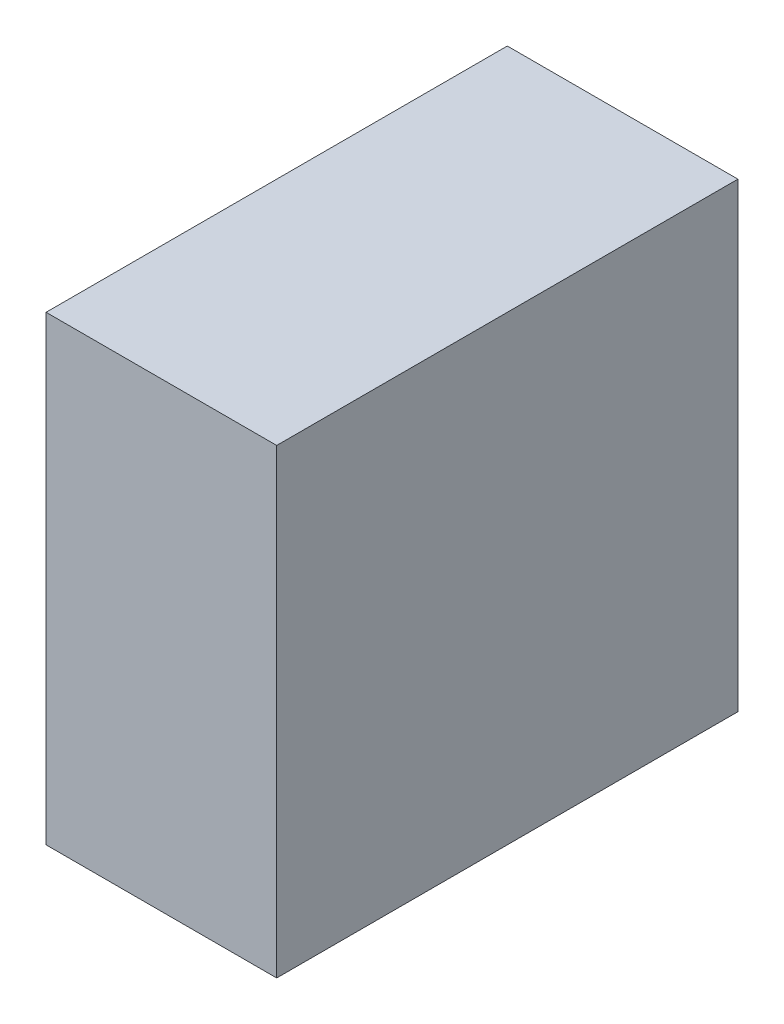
ISO-10303-21;
HEADER;
FILE_DESCRIPTION(('STEP AP214'),'2;1');
FILE_NAME('part.step','',(''),(''),'','','');
FILE_SCHEMA(('AUTOMOTIVE_DESIGN { 1 0 10303 214 1 1 1 1 }'));
ENDSEC;
DATA;
#1=APPLICATION_CONTEXT('core data for automotive mechanical design processes');
#2=APPLICATION_PROTOCOL_DEFINITION('international standard','automotive_design',2000,#1);
#3=PRODUCT_CONTEXT('',#1,'mechanical');
#4=PRODUCT('Part','Part','',(#3));
#5=PRODUCT_RELATED_PRODUCT_CATEGORY('part','',(#4));
#6=PRODUCT_DEFINITION_FORMATION('','',#4);
#7=PRODUCT_DEFINITION_CONTEXT('part definition',#1,'design');
#8=PRODUCT_DEFINITION('design','',#6,#7);
#9=PRODUCT_DEFINITION_SHAPE('','',#8);
#10=(LENGTH_UNIT() NAMED_UNIT(*) SI_UNIT(.MILLI.,.METRE.));
#11=(NAMED_UNIT(*) PLANE_ANGLE_UNIT() SI_UNIT($,.RADIAN.));
#12=(NAMED_UNIT(*) SI_UNIT($,.STERADIAN.) SOLID_ANGLE_UNIT());
#13=UNCERTAINTY_MEASURE_WITH_UNIT(LENGTH_MEASURE(1.E-05),#10,'distance_accuracy_value','');
#14=(GEOMETRIC_REPRESENTATION_CONTEXT(3) GLOBAL_UNCERTAINTY_ASSIGNED_CONTEXT((#13)) GLOBAL_UNIT_ASSIGNED_CONTEXT((#10,
#11,#12)) REPRESENTATION_CONTEXT('',''));
#15=CARTESIAN_POINT('',(0.,0.,0.));
#16=DIRECTION('',(0.,0.,1.));
#17=DIRECTION('',(1.,0.,0.));
#18=AXIS2_PLACEMENT_3D('',#15,#16,#17);
#19=CARTESIAN_POINT('',(0.127,0.254,0.));
#20=DIRECTION('',(1.,0.,0.));
#21=DIRECTION('',(0.,0.,-1.));
#22=AXIS2_PLACEMENT_3D('',#19,#20,#21);
#23=PLANE('',#22);
#24=DIRECTION('',(0.,0.,-1.));
#25=VECTOR('',#24,1.);
#26=CARTESIAN_POINT('',(0.127,-0.254,0.));
#27=LINE('',#26,#25);
#28=CARTESIAN_POINT('',(0.127,-0.254,0.));
#29=VERTEX_POINT('',#28);
#30=CARTESIAN_POINT('',(0.127,-0.254,0.508));
#31=VERTEX_POINT('',#30);
#32=EDGE_CURVE('E20',#29,#31,#27,.F.);
#33=ORIENTED_EDGE('',*,*,#32,.F.);
#34=DIRECTION('',(0.,1.,0.));
#35=VECTOR('',#34,1.);
#36=CARTESIAN_POINT('',(0.127,-0.254,0.));
#37=LINE('',#36,#35);
#38=CARTESIAN_POINT('',(0.127,0.254,0.));
#39=VERTEX_POINT('',#38);
#40=EDGE_CURVE('E79',#29,#39,#37,.T.);
#41=ORIENTED_EDGE('',*,*,#40,.T.);
#42=DIRECTION('',(0.,0.,1.));
#43=VECTOR('',#42,1.);
#44=CARTESIAN_POINT('',(0.127,0.254,0.));
#45=LINE('',#44,#43);
#46=CARTESIAN_POINT('',(0.127,0.254,0.508));
#47=VERTEX_POINT('',#46);
#48=EDGE_CURVE('E61',#47,#39,#45,.F.);
#49=ORIENTED_EDGE('',*,*,#48,.F.);
#50=DIRECTION('',(0.,1.,0.));
#51=VECTOR('',#50,1.);
#52=CARTESIAN_POINT('',(0.127,-0.254,0.508));
#53=LINE('',#52,#51);
#54=EDGE_CURVE('E56',#31,#47,#53,.T.);
#55=ORIENTED_EDGE('',*,*,#54,.F.);
#56=EDGE_LOOP('',(#33,#41,#49,#55));
#57=FACE_BOUND('',#56,.T.);
#58=ADVANCED_FACE('F17',(#57),#23,.T.);
#59=CARTESIAN_POINT('',(0.127,-0.254,0.));
#60=DIRECTION('',(0.,-1.,0.));
#61=DIRECTION('',(0.,0.,-1.));
#62=AXIS2_PLACEMENT_3D('',#59,#60,#61);
#63=PLANE('',#62);
#64=DIRECTION('',(0.,0.,1.));
#65=VECTOR('',#64,1.);
#66=CARTESIAN_POINT('',(-0.127,-0.254,0.));
#67=LINE('',#66,#65);
#68=CARTESIAN_POINT('',(-0.127,-0.254,0.));
#69=VERTEX_POINT('',#68);
#70=CARTESIAN_POINT('',(-0.127,-0.254,0.508));
#71=VERTEX_POINT('',#70);
#72=EDGE_CURVE('E83',#69,#71,#67,.T.);
#73=ORIENTED_EDGE('',*,*,#72,.F.);
#74=DIRECTION('',(1.,0.,0.));
#75=VECTOR('',#74,1.);
#76=CARTESIAN_POINT('',(0.127,-0.254,0.));
#77=LINE('',#76,#75);
#78=EDGE_CURVE('E68',#69,#29,#77,.T.);
#79=ORIENTED_EDGE('',*,*,#78,.T.);
#80=ORIENTED_EDGE('',*,*,#32,.T.);
#81=DIRECTION('',(1.,0.,0.));
#82=VECTOR('',#81,1.);
#83=CARTESIAN_POINT('',(0.127,-0.254,0.508));
#84=LINE('',#83,#82);
#85=EDGE_CURVE('E63',#71,#31,#84,.T.);
#86=ORIENTED_EDGE('',*,*,#85,.F.);
#87=EDGE_LOOP('',(#73,#79,#80,#86));
#88=FACE_BOUND('',#87,.T.);
#89=ADVANCED_FACE('F65',(#88),#63,.T.);
#90=CARTESIAN_POINT('',(0.127,-0.254,0.508));
#91=DIRECTION('',(0.,0.,1.));
#92=DIRECTION('',(1.,0.,0.));
#93=AXIS2_PLACEMENT_3D('',#90,#91,#92);
#94=PLANE('',#93);
#95=DIRECTION('',(0.,1.,0.));
#96=VECTOR('',#95,1.);
#97=CARTESIAN_POINT('',(-0.127,-0.254,0.508));
#98=LINE('',#97,#96);
#99=CARTESIAN_POINT('',(-0.127,0.254,0.508));
#100=VERTEX_POINT('',#99);
#101=EDGE_CURVE('E72',#71,#100,#98,.T.);
#102=ORIENTED_EDGE('',*,*,#101,.F.);
#103=ORIENTED_EDGE('',*,*,#85,.T.);
#104=ORIENTED_EDGE('',*,*,#54,.T.);
#105=DIRECTION('',(1.,0.,0.));
#106=VECTOR('',#105,1.);
#107=CARTESIAN_POINT('',(-0.127,0.254,0.508));
#108=LINE('',#107,#106);
#109=EDGE_CURVE('E74',#100,#47,#108,.T.);
#110=ORIENTED_EDGE('',*,*,#109,.F.);
#111=EDGE_LOOP('',(#102,#103,#104,#110));
#112=FACE_BOUND('',#111,.T.);
#113=ADVANCED_FACE('F70',(#112),#94,.T.);
#114=CARTESIAN_POINT('',(-0.127,0.254,0.));
#115=DIRECTION('',(0.,1.,0.));
#116=DIRECTION('',(0.,0.,1.));
#117=AXIS2_PLACEMENT_3D('',#114,#115,#116);
#118=PLANE('',#117);
#119=ORIENTED_EDGE('',*,*,#48,.T.);
#120=DIRECTION('',(1.,0.,0.));
#121=VECTOR('',#120,1.);
#122=CARTESIAN_POINT('',(0.127,0.254,0.));
#123=LINE('',#122,#121);
#124=CARTESIAN_POINT('',(-0.127,0.254,0.));
#125=VERTEX_POINT('',#124);
#126=EDGE_CURVE('E35',#39,#125,#123,.F.);
#127=ORIENTED_EDGE('',*,*,#126,.T.);
#128=DIRECTION('',(0.,0.,1.));
#129=VECTOR('',#128,1.);
#130=CARTESIAN_POINT('',(-0.127,0.254,0.));
#131=LINE('',#130,#129);
#132=EDGE_CURVE('E26',#100,#125,#131,.F.);
#133=ORIENTED_EDGE('',*,*,#132,.F.);
#134=ORIENTED_EDGE('',*,*,#109,.T.);
#135=EDGE_LOOP('',(#119,#127,#133,#134));
#136=FACE_BOUND('',#135,.T.);
#137=ADVANCED_FACE('F89',(#136),#118,.T.);
#138=CARTESIAN_POINT('',(0.127,-0.254,0.));
#139=DIRECTION('',(0.,0.,1.));
#140=DIRECTION('',(1.,0.,0.));
#141=AXIS2_PLACEMENT_3D('',#138,#139,#140);
#142=PLANE('',#141);
#143=DIRECTION('',(0.,1.,0.));
#144=VECTOR('',#143,1.);
#145=CARTESIAN_POINT('',(-0.127,-0.254,0.));
#146=LINE('',#145,#144);
#147=EDGE_CURVE('E11',#125,#69,#146,.F.);
#148=ORIENTED_EDGE('',*,*,#147,.F.);
#149=ORIENTED_EDGE('',*,*,#126,.F.);
#150=ORIENTED_EDGE('',*,*,#40,.F.);
#151=ORIENTED_EDGE('',*,*,#78,.F.);
#152=EDGE_LOOP('',(#148,#149,#150,#151));
#153=FACE_BOUND('',#152,.T.);
#154=ADVANCED_FACE('F91',(#153),#142,.F.);
#155=CARTESIAN_POINT('',(-0.127,-0.254,0.));
#156=DIRECTION('',(-1.,0.,0.));
#157=DIRECTION('',(0.,0.,1.));
#158=AXIS2_PLACEMENT_3D('',#155,#156,#157);
#159=PLANE('',#158);
#160=ORIENTED_EDGE('',*,*,#132,.T.);
#161=ORIENTED_EDGE('',*,*,#147,.T.);
#162=ORIENTED_EDGE('',*,*,#72,.T.);
#163=ORIENTED_EDGE('',*,*,#101,.T.);
#164=EDGE_LOOP('',(#160,#161,#162,#163));
#165=FACE_BOUND('',#164,.T.);
#166=ADVANCED_FACE('F88',(#165),#159,.T.);
#167=CLOSED_SHELL('',(#58,#89,#113,#137,#154,#166));
#168=MANIFOLD_SOLID_BREP('B1',#167);
#169=ADVANCED_BREP_SHAPE_REPRESENTATION('',(#18,#168),#14);
#170=SHAPE_DEFINITION_REPRESENTATION(#9,#169);
ENDSEC;
END-ISO-10303-21;
